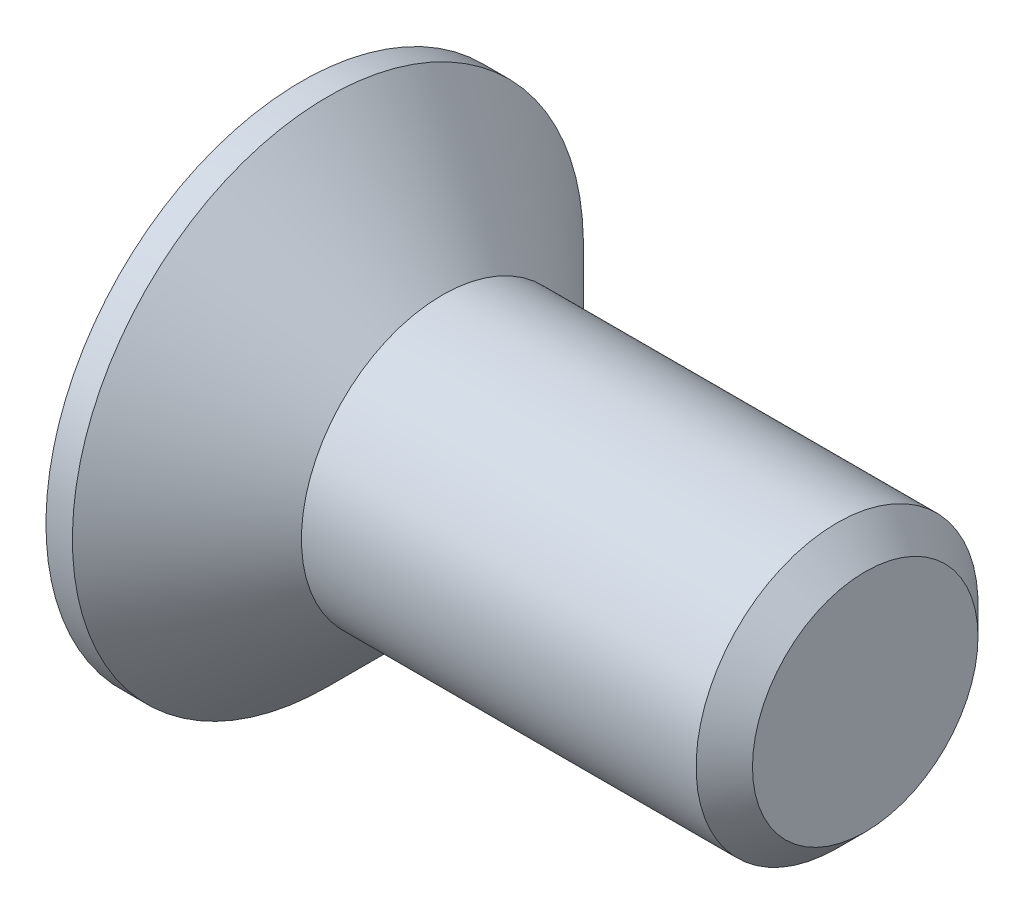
from build123d import *

# Parameters (mm, degrees)
CHAMFER1_SIZE      = 0.8
CUT_EXTRUDE1_DEPTH = 3.45


with BuildPart() as part:
    # Sketch1 → Revolve1 (revolve)
    with BuildSketch(Plane.XY, mode=Mode.PRIVATE) as revolve1_sk:
        Polygon((-4, 7.25), (-4, 0), (12, 0), (12, 4), (0, 4), (-3.25, 7.25), align=None)
    revolve(revolve1_sk.sketch.rotate(Axis((-4, 0, 0), (1, 0, 0)), 180), axis=Axis((-4, 0, 0), (1, 0, 0)))

    # Chamfer1
    chamfer1_edges = [part.edges().sort_by_distance(p)[0] for p in [
        (12, 4, 0),
    ]]
    chamfer(chamfer1_edges, length=CHAMFER1_SIZE)

    # Sketch2 → Cut-Extrude1 (cut)
    with BuildSketch(Plane.ZY.offset(4)):
        Polygon((-1.09, 4.35), (1.09, 4.35), (1.09, 1.09), (4.35, 1.09), (4.35, -1.09), (1.09, -1.09), (1.09, -4.35), (-1.09, -4.35), (-1.09, -1.09), (-4.35, -1.09), (-4.35, 1.09), (-1.09, 1.09), align=None)
    extrude(amount=-CUT_EXTRUDE1_DEPTH, mode=Mode.SUBTRACT)


solid = part.part
